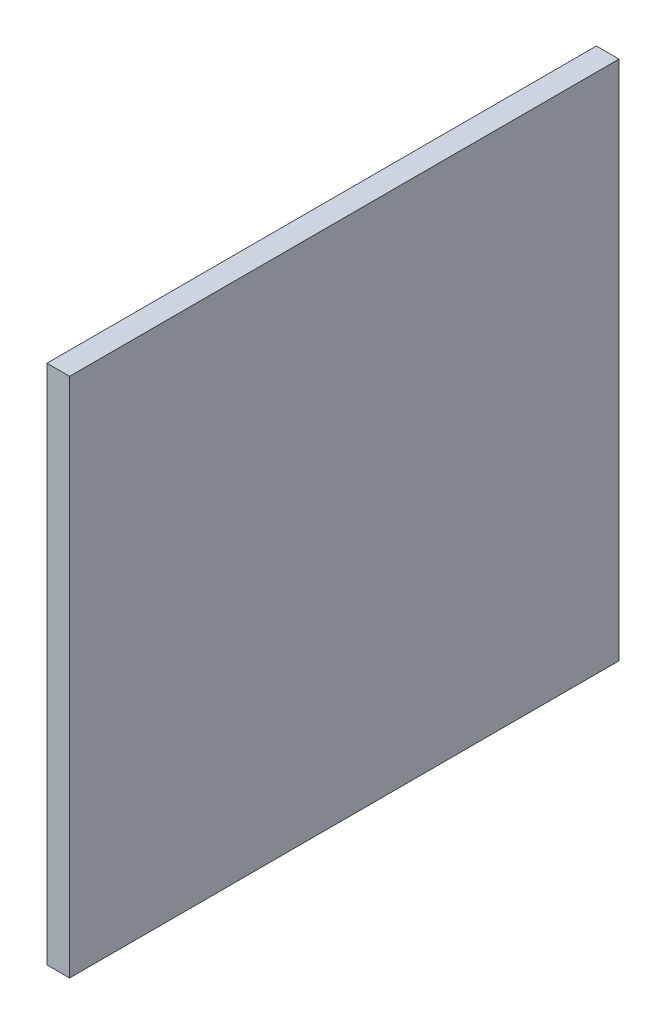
from build123d import *

# Parameters (mm, degrees)
CROQUIS1_W              = 970
CROQUIS1_H              = 920
SALIENTE_EXTRUIR1_DEPTH = 40


with BuildPart() as part:
    # Croquis1 → Saliente-Extruir1 (new body)
    with BuildSketch(Plane(origin=(0, 0, 0), x_dir=(0, 0, -1), z_dir=(1, 0, 0))):
        with Locations((485, 460)):
            Rectangle(CROQUIS1_W, CROQUIS1_H)
    extrude(amount=SALIENTE_EXTRUIR1_DEPTH)


solid = part.part
